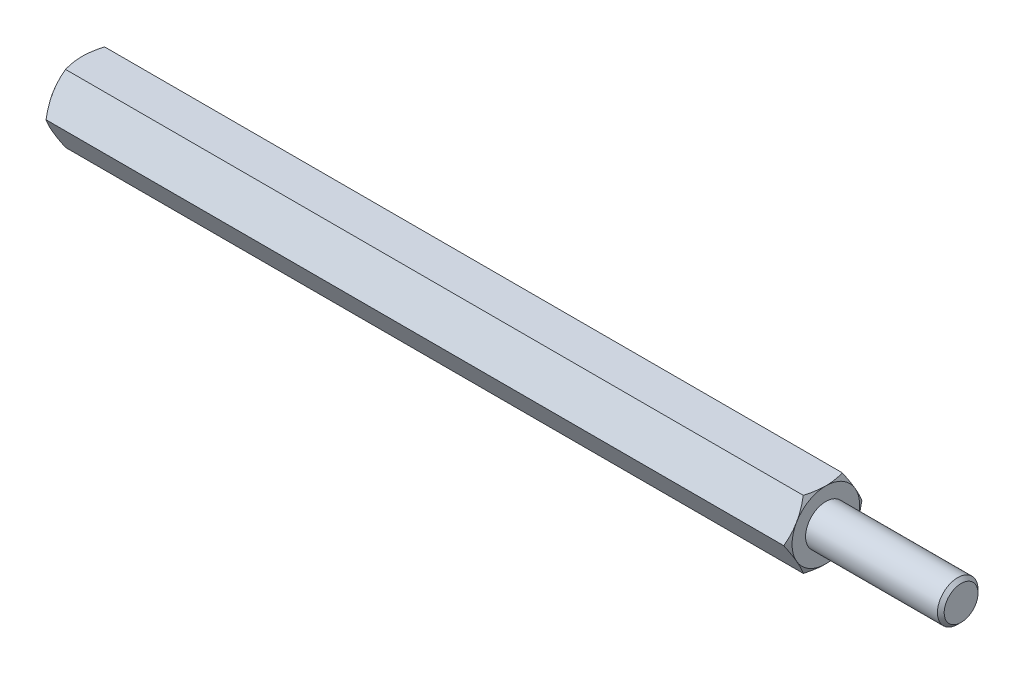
ISO-10303-21;
HEADER;
FILE_DESCRIPTION(('STEP AP214'),'2;1');
FILE_NAME('part.step','',(''),(''),'','','');
FILE_SCHEMA(('AUTOMOTIVE_DESIGN { 1 0 10303 214 1 1 1 1 }'));
ENDSEC;
DATA;
#1=APPLICATION_CONTEXT('core data for automotive mechanical design processes');
#2=APPLICATION_PROTOCOL_DEFINITION('international standard','automotive_design',2000,#1);
#3=PRODUCT_CONTEXT('',#1,'mechanical');
#4=PRODUCT('Part','Part','',(#3));
#5=PRODUCT_RELATED_PRODUCT_CATEGORY('part','',(#4));
#6=PRODUCT_DEFINITION_FORMATION('','',#4);
#7=PRODUCT_DEFINITION_CONTEXT('part definition',#1,'design');
#8=PRODUCT_DEFINITION('design','',#6,#7);
#9=PRODUCT_DEFINITION_SHAPE('','',#8);
#10=(LENGTH_UNIT() NAMED_UNIT(*) SI_UNIT(.MILLI.,.METRE.));
#11=(NAMED_UNIT(*) PLANE_ANGLE_UNIT() SI_UNIT($,.RADIAN.));
#12=(NAMED_UNIT(*) SI_UNIT($,.STERADIAN.) SOLID_ANGLE_UNIT());
#13=UNCERTAINTY_MEASURE_WITH_UNIT(LENGTH_MEASURE(1.E-05),#10,'distance_accuracy_value','');
#14=(GEOMETRIC_REPRESENTATION_CONTEXT(3) GLOBAL_UNCERTAINTY_ASSIGNED_CONTEXT((#13)) GLOBAL_UNIT_ASSIGNED_CONTEXT((#10,
#11,#12)) REPRESENTATION_CONTEXT('',''));
#15=CARTESIAN_POINT('',(0.,0.,0.));
#16=DIRECTION('',(0.,0.,1.));
#17=DIRECTION('',(1.,0.,0.));
#18=AXIS2_PLACEMENT_3D('',#15,#16,#17);
#19=CARTESIAN_POINT('',(27.5,2.5,-1.44337567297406));
#20=DIRECTION('',(1.,0.,0.));
#21=DIRECTION('',(0.,0.,-1.));
#22=AXIS2_PLACEMENT_3D('',#19,#20,#21);
#23=PLANE('',#22);
#24=CARTESIAN_POINT('',(27.5,0.,0.));
#25=DIRECTION('',(1.,0.,0.));
#26=DIRECTION('',(0.,0.,-1.));
#27=AXIS2_PLACEMENT_3D('',#24,#25,#26);
#28=CIRCLE('',#27,2.50000000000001);
#29=CARTESIAN_POINT('',(27.5,-1.25,-2.16506350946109));
#30=VERTEX_POINT('',#29);
#31=CARTESIAN_POINT('',(27.5,1.25,-2.1650635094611));
#32=VERTEX_POINT('',#31);
#33=EDGE_CURVE('E288',#30,#32,#28,.T.);
#34=ORIENTED_EDGE('',*,*,#33,.T.);
#35=CARTESIAN_POINT('',(27.5,2.5,0.));
#36=VERTEX_POINT('',#35);
#37=EDGE_CURVE('E53',#32,#36,#28,.T.);
#38=ORIENTED_EDGE('',*,*,#37,.T.);
#39=CARTESIAN_POINT('',(27.5,1.25,2.1650635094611));
#40=VERTEX_POINT('',#39);
#41=EDGE_CURVE('E297',#36,#40,#28,.T.);
#42=ORIENTED_EDGE('',*,*,#41,.T.);
#43=CARTESIAN_POINT('',(27.5,-1.25000000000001,2.1650635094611));
#44=VERTEX_POINT('',#43);
#45=EDGE_CURVE('E303',#40,#44,#28,.T.);
#46=ORIENTED_EDGE('',*,*,#45,.T.);
#47=CARTESIAN_POINT('',(27.5,0.,0.));
#48=DIRECTION('',(-1.,0.,0.));
#49=DIRECTION('',(0.,-1.,0.));
#50=AXIS2_PLACEMENT_3D('',#47,#48,#49);
#51=CIRCLE('',#50,2.50000000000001);
#52=CARTESIAN_POINT('',(27.5,-2.50000000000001,0.));
#53=VERTEX_POINT('',#52);
#54=EDGE_CURVE('E193',#53,#44,#51,.T.);
#55=ORIENTED_EDGE('',*,*,#54,.F.);
#56=EDGE_CURVE('E61',#53,#30,#28,.T.);
#57=ORIENTED_EDGE('',*,*,#56,.T.);
#58=EDGE_LOOP('',(#34,#38,#42,#46,#55,#57));
#59=FACE_BOUND('',#58,.T.);
#60=CARTESIAN_POINT('',(27.5,0.,0.));
#61=DIRECTION('',(1.,0.,0.));
#62=DIRECTION('',(0.,0.,-1.));
#63=AXIS2_PLACEMENT_3D('',#60,#61,#62);
#64=CIRCLE('',#63,1.5);
#65=CARTESIAN_POINT('',(27.5,0.,-1.5));
#66=VERTEX_POINT('',#65);
#67=EDGE_CURVE('E617',#66,#66,#64,.T.);
#68=ORIENTED_EDGE('',*,*,#67,.F.);
#69=EDGE_LOOP('',(#68));
#70=FACE_BOUND('',#69,.T.);
#71=ADVANCED_FACE('F37',(#59,#70),#23,.T.);
#72=CARTESIAN_POINT('',(27.5,0.,-2.88675134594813));
#73=DIRECTION('',(0.,-0.5,0.866025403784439));
#74=DIRECTION('',(0.,-0.866025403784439,-0.5));
#75=AXIS2_PLACEMENT_3D('',#72,#73,#74);
#76=PLANE('',#75);
#77=CARTESIAN_POINT('',(27.2766423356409,-0.000200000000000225,-2.88686681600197));
#78=CARTESIAN_POINT('',(27.3132783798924,0.109663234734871,-2.82343724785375));
#79=CARTESIAN_POINT('',(27.3465977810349,0.220474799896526,-2.75946016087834));
#80=CARTESIAN_POINT('',(27.4047577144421,0.444016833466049,-2.63039810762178));
#81=CARTESIAN_POINT('',(27.4295776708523,0.556751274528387,-2.5653108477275));
#82=CARTESIAN_POINT('',(27.468214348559,0.780822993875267,-2.43594298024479));
#83=CARTESIAN_POINT('',(27.4822882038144,0.892125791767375,-2.37168227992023));
#84=CARTESIAN_POINT('',(27.4990908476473,1.11525522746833,-2.24285844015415));
#85=CARTESIAN_POINT('',(27.5018335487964,1.22708105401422,-2.17829576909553));
#86=CARTESIAN_POINT('',(27.4961342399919,1.43604197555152,-2.05765212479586));
#87=CARTESIAN_POINT('',(27.4890916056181,1.53320831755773,-2.0015531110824));
#88=CARTESIAN_POINT('',(27.4667685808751,1.726907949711,-1.88972057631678));
#89=CARTESIAN_POINT('',(27.4514805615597,1.82344056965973,-1.8339874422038));
#90=CARTESIAN_POINT('',(27.4132609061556,2.01753972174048,-1.7219242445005));
#91=CARTESIAN_POINT('',(27.3901672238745,2.11508168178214,-1.66560836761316));
#92=CARTESIAN_POINT('',(27.3377533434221,2.30871060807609,-1.55381665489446));
#93=CARTESIAN_POINT('',(27.3084454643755,2.40480005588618,-1.49833938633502));
#94=CARTESIAN_POINT('',(27.2766423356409,2.5002,-1.44326020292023));
#95=B_SPLINE_CURVE_WITH_KNOTS('',3,(#77,#78,#79,#80,#81,#82,#83,#84,#85,#86,#87,#88,#89,#90,#91,
#92,#93,#94),.UNSPECIFIED.,.F.,.F.,(4,2,2,2,2,2,2,2,4),(0.,0.396285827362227,0.793524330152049,
1.18093086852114,1.56786160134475,1.90479741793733,2.24204551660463,2.58677531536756,
2.93082800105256),.UNSPECIFIED.);
#96=CARTESIAN_POINT('',(27.2767090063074,0.,-2.88675134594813));
#97=VERTEX_POINT('',#96);
#98=EDGE_CURVE('E317',#97,#32,#95,.T.);
#99=ORIENTED_EDGE('',*,*,#98,.F.);
#100=DIRECTION('',(-1.,0.,0.));
#101=VECTOR('',#100,1.);
#102=CARTESIAN_POINT('',(27.5,0.,-2.88675134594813));
#103=LINE('',#102,#101);
#104=CARTESIAN_POINT('',(-27.2767090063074,0.,-2.88675134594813));
#105=VERTEX_POINT('',#104);
#106=EDGE_CURVE('E264',#97,#105,#103,.T.);
#107=ORIENTED_EDGE('',*,*,#106,.T.);
#108=CARTESIAN_POINT('',(-27.2766423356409,2.5002,-1.44326020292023));
#109=CARTESIAN_POINT('',(-27.3132783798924,2.39033676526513,-1.50668977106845));
#110=CARTESIAN_POINT('',(-27.3465977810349,2.27952520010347,-1.57066685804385));
#111=CARTESIAN_POINT('',(-27.4047577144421,2.05598316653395,-1.69972891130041));
#112=CARTESIAN_POINT('',(-27.4295776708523,1.94324872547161,-1.7648161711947));
#113=CARTESIAN_POINT('',(-27.468214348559,1.71917700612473,-1.8941840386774));
#114=CARTESIAN_POINT('',(-27.4822882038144,1.60787420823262,-1.95844473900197));
#115=CARTESIAN_POINT('',(-27.4990908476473,1.38474477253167,-2.08726857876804));
#116=CARTESIAN_POINT('',(-27.5018335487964,1.27291894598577,-2.15183124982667));
#117=CARTESIAN_POINT('',(-27.4961342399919,1.06395802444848,-2.27247489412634));
#118=CARTESIAN_POINT('',(-27.4890916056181,0.966791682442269,-2.32857390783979));
#119=CARTESIAN_POINT('',(-27.4667685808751,0.773092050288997,-2.44040644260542));
#120=CARTESIAN_POINT('',(-27.4514805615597,0.676559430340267,-2.4961395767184));
#121=CARTESIAN_POINT('',(-27.4132609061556,0.482460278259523,-2.60820277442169));
#122=CARTESIAN_POINT('',(-27.3901672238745,0.384918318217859,-2.66451865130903));
#123=CARTESIAN_POINT('',(-27.3377533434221,0.191289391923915,-2.77631036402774));
#124=CARTESIAN_POINT('',(-27.3084454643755,0.0951999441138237,-2.83178763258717));
#125=CARTESIAN_POINT('',(-27.2766423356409,-0.000200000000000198,-2.88686681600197));
#126=B_SPLINE_CURVE_WITH_KNOTS('',3,(#108,#109,#110,#111,#112,#113,#114,#115,#116,#117,#118,
#119,#120,#121,#122,#123,#124,#125),.UNSPECIFIED.,.F.,.F.,(4,2,2,2,2,2,2,2,4),(0.,
0.396285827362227,0.79352433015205,1.18093086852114,1.56786160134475,1.90479741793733,
2.24204551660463,2.58677531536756,2.93082800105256),.UNSPECIFIED.);
#127=CARTESIAN_POINT('',(-27.5,1.25,-2.1650635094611));
#128=VERTEX_POINT('',#127);
#129=EDGE_CURVE('E379',#128,#105,#126,.T.);
#130=ORIENTED_EDGE('',*,*,#129,.F.);
#131=CARTESIAN_POINT('',(-27.2767090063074,2.5,-1.44337567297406));
#132=VERTEX_POINT('',#131);
#133=EDGE_CURVE('E356',#132,#128,#126,.T.);
#134=ORIENTED_EDGE('',*,*,#133,.F.);
#135=DIRECTION('',(-1.,0.,0.));
#136=VECTOR('',#135,1.);
#137=CARTESIAN_POINT('',(27.5,2.5,-1.44337567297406));
#138=LINE('',#137,#136);
#139=CARTESIAN_POINT('',(27.2767090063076,2.5,-1.44337567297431));
#140=VERTEX_POINT('',#139);
#141=EDGE_CURVE('E279',#140,#132,#138,.T.);
#142=ORIENTED_EDGE('',*,*,#141,.F.);
#143=EDGE_CURVE('E229',#32,#140,#95,.T.);
#144=ORIENTED_EDGE('',*,*,#143,.F.);
#145=EDGE_LOOP('',(#99,#107,#130,#134,#142,#144));
#146=FACE_BOUND('',#145,.T.);
#147=ADVANCED_FACE('F148',(#146),#76,.F.);
#148=CARTESIAN_POINT('',(27.5,2.5,-1.44337567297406));
#149=DIRECTION('',(0.,-1.,0.));
#150=DIRECTION('',(0.,0.,-1.));
#151=AXIS2_PLACEMENT_3D('',#148,#149,#150);
#152=PLANE('',#151);
#153=CARTESIAN_POINT('',(26.2680338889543,2.5,-3.90158441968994));
#154=CARTESIAN_POINT('',(26.3212077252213,2.5,-3.79217004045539));
#155=CARTESIAN_POINT('',(26.3738786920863,2.5,-3.68250707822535));
#156=CARTESIAN_POINT('',(26.4779324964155,2.5,-3.46255185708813));
#157=CARTESIAN_POINT('',(26.5293151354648,2.5,-3.35225950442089));
#158=CARTESIAN_POINT('',(26.6307630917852,2.5,-3.13035696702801));
#159=CARTESIAN_POINT('',(26.6808199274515,2.5,-3.0187428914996));
#160=CARTESIAN_POINT('',(26.7789171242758,2.5,-2.79463535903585));
#161=CARTESIAN_POINT('',(26.8269575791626,2.5,-2.6821419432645));
#162=CARTESIAN_POINT('',(26.9220184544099,2.5,-2.45240385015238));
#163=CARTESIAN_POINT('',(26.9689543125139,2.5,-2.33512399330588));
#164=CARTESIAN_POINT('',(27.0593326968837,2.5,-2.09920133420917));
#165=CARTESIAN_POINT('',(27.1027748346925,2.5,-1.98055838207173));
#166=CARTESIAN_POINT('',(27.1850435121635,2.5,-1.74193489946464));
#167=CARTESIAN_POINT('',(27.2238791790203,2.5,-1.62195754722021));
#168=CARTESIAN_POINT('',(27.2957050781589,2.5,-1.38028205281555));
#169=CARTESIAN_POINT('',(27.3286971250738,2.5,-1.25858445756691));
#170=CARTESIAN_POINT('',(27.3870959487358,2.5,-1.01406369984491));
#171=CARTESIAN_POINT('',(27.4125437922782,2.5,-0.891250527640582));
#172=CARTESIAN_POINT('',(27.4544275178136,2.5,-0.644071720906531));
#173=CARTESIAN_POINT('',(27.4708643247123,2.5,-0.519706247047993));
#174=CARTESIAN_POINT('',(27.4932006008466,2.5,-0.271679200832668));
#175=CARTESIAN_POINT('',(27.4992375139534,2.5,-0.148030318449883));
#176=CARTESIAN_POINT('',(27.5006256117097,2.5,0.0993395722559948));
#177=CARTESIAN_POINT('',(27.4959765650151,2.5,0.223060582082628));
#178=CARTESIAN_POINT('',(27.4794044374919,2.5,0.432351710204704));
#179=CARTESIAN_POINT('',(27.4701066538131,2.5,0.518143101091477));
#180=CARTESIAN_POINT('',(27.4469384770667,2.5,0.689112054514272));
#181=CARTESIAN_POINT('',(27.4330674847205,2.5,0.774289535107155));
#182=CARTESIAN_POINT('',(27.3853202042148,2.5,1.02876599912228));
#183=CARTESIAN_POINT('',(27.3453176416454,2.5,1.19691958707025));
#184=CARTESIAN_POINT('',(27.2522656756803,2.5,1.53362893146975));
#185=CARTESIAN_POINT('',(27.1989362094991,2.5,1.70210423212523));
#186=CARTESIAN_POINT('',(27.1123716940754,2.5,1.95247339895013));
#187=CARTESIAN_POINT('',(27.0824247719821,2.5,2.03553184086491));
#188=CARTESIAN_POINT('',(27.0206840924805,2.5,2.20095860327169));
#189=CARTESIAN_POINT('',(26.9888903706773,2.5,2.28332693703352));
#190=CARTESIAN_POINT('',(26.904014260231,2.5,2.49723312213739));
#191=CARTESIAN_POINT('',(26.8497173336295,2.5,2.62828796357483));
#192=CARTESIAN_POINT('',(26.7381273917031,2.5,2.88912034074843));
#193=CARTESIAN_POINT('',(26.6808341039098,2.5,3.01889775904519));
#194=CARTESIAN_POINT('',(26.5639348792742,2.5,3.2774504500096));
#195=CARTESIAN_POINT('',(26.504328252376,2.5,3.40622540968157));
#196=CARTESIAN_POINT('',(26.3833234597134,2.5,3.6629323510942));
#197=CARTESIAN_POINT('',(26.321925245,2.5,3.79086430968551));
#198=CARTESIAN_POINT('',(26.1354580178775,2.5,4.17399495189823));
#199=CARTESIAN_POINT('',(26.0082824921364,2.5,4.4281672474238));
#200=CARTESIAN_POINT('',(25.7503455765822,2.5,4.93461464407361));
#201=CARTESIAN_POINT('',(25.6195848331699,2.5,5.18689007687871));
#202=CARTESIAN_POINT('',(25.3687100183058,2.5,5.6651245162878));
#203=CARTESIAN_POINT('',(25.2488298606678,2.5,5.89120644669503));
#204=CARTESIAN_POINT('',(25.0075902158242,2.5,6.3425936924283));
#205=CARTESIAN_POINT('',(24.8862306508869,2.5,6.56789896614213));
#206=CARTESIAN_POINT('',(24.642780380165,2.5,7.01722044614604));
#207=CARTESIAN_POINT('',(24.5206930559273,2.5,7.2412384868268));
#208=CARTESIAN_POINT('',(24.2756662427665,2.5,7.68878772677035));
#209=CARTESIAN_POINT('',(24.152726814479,2.5,7.91231895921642));
#210=CARTESIAN_POINT('',(24.0294756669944,2.5,8.13567697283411));
#211=B_SPLINE_CURVE_WITH_KNOTS('',3,(#153,#154,#155,#156,#157,#158,#159,#160,#161,#162,#163,
#164,#165,#166,#167,#168,#169,#170,#171,#172,#173,#174,#175,#176,#177,#178,#179,#180,#181,#182,
#183,#184,#185,#186,#187,#188,#189,#190,#191,#192,#193,#194,#195,#196,#197,#198,#199,#200,#201,
#202,#203,#204,#205,#206,#207,#208,#209,#210),.UNSPECIFIED.,.F.,.F.,(4,2,2,2,2,2,2,2,2,2,2,2,2,
2,2,2,2,2,2,2,2,2,2,2,2,2,2,2,4),(0.,0.364957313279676,0.729970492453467,1.09692930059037,
1.46387103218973,1.84279746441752,2.22176597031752,2.59997058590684,2.97805755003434,
3.3540469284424,3.72999770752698,4.10094071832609,4.47189175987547,4.73064905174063,
4.98944026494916,5.50729076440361,6.03710483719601,6.30196454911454,6.56681915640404,
6.99233818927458,7.41789598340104,7.84358170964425,8.26927907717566,9.12186602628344,
9.97430025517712,10.7419897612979,11.509719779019,12.2750964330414,13.0404191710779),.UNSPECIFIED.);
#212=EDGE_CURVE('E227',#140,#36,#211,.T.);
#213=ORIENTED_EDGE('',*,*,#212,.F.);
#214=ORIENTED_EDGE('',*,*,#141,.T.);
#215=CARTESIAN_POINT('',(-26.2680338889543,2.5,-3.90158441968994));
#216=CARTESIAN_POINT('',(-26.3212077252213,2.5,-3.79217004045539));
#217=CARTESIAN_POINT('',(-26.3738786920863,2.5,-3.68250707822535));
#218=CARTESIAN_POINT('',(-26.4779324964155,2.5,-3.46255185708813));
#219=CARTESIAN_POINT('',(-26.5293151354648,2.5,-3.35225950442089));
#220=CARTESIAN_POINT('',(-26.6307630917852,2.5,-3.13035696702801));
#221=CARTESIAN_POINT('',(-26.6808199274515,2.5,-3.0187428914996));
#222=CARTESIAN_POINT('',(-26.7789171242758,2.5,-2.79463535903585));
#223=CARTESIAN_POINT('',(-26.8269575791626,2.5,-2.6821419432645));
#224=CARTESIAN_POINT('',(-26.9220184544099,2.5,-2.45240385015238));
#225=CARTESIAN_POINT('',(-26.9689543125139,2.5,-2.33512399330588));
#226=CARTESIAN_POINT('',(-27.0593326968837,2.5,-2.09920133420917));
#227=CARTESIAN_POINT('',(-27.1027748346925,2.5,-1.98055838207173));
#228=CARTESIAN_POINT('',(-27.1850435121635,2.5,-1.74193489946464));
#229=CARTESIAN_POINT('',(-27.2238791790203,2.5,-1.62195754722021));
#230=CARTESIAN_POINT('',(-27.2957050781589,2.5,-1.38028205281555));
#231=CARTESIAN_POINT('',(-27.3286971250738,2.5,-1.25858445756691));
#232=CARTESIAN_POINT('',(-27.3870959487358,2.5,-1.01406369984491));
#233=CARTESIAN_POINT('',(-27.4125437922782,2.5,-0.891250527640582));
#234=CARTESIAN_POINT('',(-27.4544275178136,2.5,-0.644071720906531));
#235=CARTESIAN_POINT('',(-27.4708643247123,2.5,-0.519706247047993));
#236=CARTESIAN_POINT('',(-27.4932006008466,2.5,-0.271679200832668));
#237=CARTESIAN_POINT('',(-27.4992375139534,2.5,-0.148030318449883));
#238=CARTESIAN_POINT('',(-27.5006256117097,2.5,0.0993395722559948));
#239=CARTESIAN_POINT('',(-27.4959765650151,2.5,0.223060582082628));
#240=CARTESIAN_POINT('',(-27.4794044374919,2.5,0.432351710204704));
#241=CARTESIAN_POINT('',(-27.4701066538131,2.5,0.518143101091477));
#242=CARTESIAN_POINT('',(-27.4469384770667,2.5,0.689112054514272));
#243=CARTESIAN_POINT('',(-27.4330674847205,2.5,0.774289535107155));
#244=CARTESIAN_POINT('',(-27.3853202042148,2.5,1.02876599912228));
#245=CARTESIAN_POINT('',(-27.3453176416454,2.5,1.19691958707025));
#246=CARTESIAN_POINT('',(-27.2522656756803,2.5,1.53362893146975));
#247=CARTESIAN_POINT('',(-27.1989362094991,2.5,1.70210423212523));
#248=CARTESIAN_POINT('',(-27.1123716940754,2.5,1.95247339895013));
#249=CARTESIAN_POINT('',(-27.0824247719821,2.5,2.03553184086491));
#250=CARTESIAN_POINT('',(-27.0206840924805,2.5,2.20095860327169));
#251=CARTESIAN_POINT('',(-26.9888903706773,2.5,2.28332693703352));
#252=CARTESIAN_POINT('',(-26.904014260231,2.5,2.49723312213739));
#253=CARTESIAN_POINT('',(-26.8497173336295,2.5,2.62828796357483));
#254=CARTESIAN_POINT('',(-26.7381273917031,2.5,2.88912034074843));
#255=CARTESIAN_POINT('',(-26.6808341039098,2.5,3.01889775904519));
#256=CARTESIAN_POINT('',(-26.5639348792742,2.5,3.2774504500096));
#257=CARTESIAN_POINT('',(-26.504328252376,2.5,3.40622540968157));
#258=CARTESIAN_POINT('',(-26.3833234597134,2.5,3.6629323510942));
#259=CARTESIAN_POINT('',(-26.321925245,2.5,3.79086430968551));
#260=CARTESIAN_POINT('',(-26.1354580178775,2.5,4.17399495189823));
#261=CARTESIAN_POINT('',(-26.0082824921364,2.5,4.4281672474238));
#262=CARTESIAN_POINT('',(-25.7503455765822,2.5,4.93461464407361));
#263=CARTESIAN_POINT('',(-25.6195848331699,2.5,5.18689007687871));
#264=CARTESIAN_POINT('',(-25.3687100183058,2.5,5.6651245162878));
#265=CARTESIAN_POINT('',(-25.2488298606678,2.5,5.89120644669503));
#266=CARTESIAN_POINT('',(-25.0075902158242,2.5,6.3425936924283));
#267=CARTESIAN_POINT('',(-24.8862306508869,2.5,6.56789896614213));
#268=CARTESIAN_POINT('',(-24.642780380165,2.5,7.01722044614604));
#269=CARTESIAN_POINT('',(-24.5206930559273,2.5,7.2412384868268));
#270=CARTESIAN_POINT('',(-24.2756662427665,2.5,7.68878772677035));
#271=CARTESIAN_POINT('',(-24.152726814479,2.5,7.91231895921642));
#272=CARTESIAN_POINT('',(-24.0294756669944,2.5,8.13567697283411));
#273=B_SPLINE_CURVE_WITH_KNOTS('',3,(#215,#216,#217,#218,#219,#220,#221,#222,#223,#224,#225,
#226,#227,#228,#229,#230,#231,#232,#233,#234,#235,#236,#237,#238,#239,#240,#241,#242,#243,#244,
#245,#246,#247,#248,#249,#250,#251,#252,#253,#254,#255,#256,#257,#258,#259,#260,#261,#262,#263,
#264,#265,#266,#267,#268,#269,#270,#271,#272),.UNSPECIFIED.,.F.,.F.,(4,2,2,2,2,2,2,2,2,2,2,2,2,
2,2,2,2,2,2,2,2,2,2,2,2,2,2,2,4),(0.,0.364957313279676,0.729970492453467,1.09692930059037,
1.46387103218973,1.84279746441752,2.22176597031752,2.59997058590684,2.97805755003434,
3.3540469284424,3.72999770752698,4.10094071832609,4.47189175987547,4.73064905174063,
4.98944026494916,5.50729076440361,6.03710483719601,6.30196454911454,6.56681915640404,
6.99233818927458,7.41789598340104,7.84358170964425,8.26927907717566,9.12186602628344,
9.97430025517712,10.7419897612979,11.509719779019,12.2750964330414,13.0404191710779),.UNSPECIFIED.);
#274=CARTESIAN_POINT('',(-27.5,2.5,0.));
#275=VERTEX_POINT('',#274);
#276=EDGE_CURVE('E241',#275,#132,#273,.F.);
#277=ORIENTED_EDGE('',*,*,#276,.F.);
#278=CARTESIAN_POINT('',(-27.2767090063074,2.5,1.44337567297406));
#279=VERTEX_POINT('',#278);
#280=EDGE_CURVE('E249',#279,#275,#273,.F.);
#281=ORIENTED_EDGE('',*,*,#280,.F.);
#282=DIRECTION('',(-1.,0.,0.));
#283=VECTOR('',#282,1.);
#284=CARTESIAN_POINT('',(27.5,2.5,1.44337567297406));
#285=LINE('',#284,#283);
#286=CARTESIAN_POINT('',(27.2767090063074,2.5,1.44337567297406));
#287=VERTEX_POINT('',#286);
#288=EDGE_CURVE('E276',#287,#279,#285,.T.);
#289=ORIENTED_EDGE('',*,*,#288,.F.);
#290=EDGE_CURVE('E221',#36,#287,#211,.T.);
#291=ORIENTED_EDGE('',*,*,#290,.F.);
#292=EDGE_LOOP('',(#213,#214,#277,#281,#289,#291));
#293=FACE_BOUND('',#292,.T.);
#294=ADVANCED_FACE('F153',(#293),#152,.F.);
#295=CARTESIAN_POINT('',(27.5,2.5,1.44337567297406));
#296=DIRECTION('',(0.,-0.5,-0.866025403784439));
#297=DIRECTION('',(0.,0.866025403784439,-0.5));
#298=AXIS2_PLACEMENT_3D('',#295,#296,#297);
#299=PLANE('',#298);
#300=CARTESIAN_POINT('',(27.2766423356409,2.5002,1.44326020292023));
#301=CARTESIAN_POINT('',(27.3132783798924,2.39033676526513,1.50668977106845));
#302=CARTESIAN_POINT('',(27.3465977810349,2.27952520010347,1.57066685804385));
#303=CARTESIAN_POINT('',(27.4047577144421,2.05598316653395,1.69972891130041));
#304=CARTESIAN_POINT('',(27.4295776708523,1.94324872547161,1.7648161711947));
#305=CARTESIAN_POINT('',(27.468214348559,1.71917700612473,1.8941840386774));
#306=CARTESIAN_POINT('',(27.4822882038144,1.60787420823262,1.95844473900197));
#307=CARTESIAN_POINT('',(27.4990908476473,1.38474477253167,2.08726857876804));
#308=CARTESIAN_POINT('',(27.5018335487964,1.27291894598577,2.15183124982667));
#309=CARTESIAN_POINT('',(27.4961342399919,1.06395802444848,2.27247489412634));
#310=CARTESIAN_POINT('',(27.4890916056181,0.966791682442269,2.32857390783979));
#311=CARTESIAN_POINT('',(27.4667685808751,0.773092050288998,2.44040644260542));
#312=CARTESIAN_POINT('',(27.4514805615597,0.676559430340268,2.4961395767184));
#313=CARTESIAN_POINT('',(27.4132609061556,0.482460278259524,2.60820277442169));
#314=CARTESIAN_POINT('',(27.3901672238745,0.384918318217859,2.66451865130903));
#315=CARTESIAN_POINT('',(27.3377533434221,0.191289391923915,2.77631036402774));
#316=CARTESIAN_POINT('',(27.3084454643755,0.0951999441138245,2.83178763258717));
#317=CARTESIAN_POINT('',(27.2766423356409,-0.000199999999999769,2.88686681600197));
#318=B_SPLINE_CURVE_WITH_KNOTS('',3,(#300,#301,#302,#303,#304,#305,#306,#307,#308,#309,#310,
#311,#312,#313,#314,#315,#316,#317),.UNSPECIFIED.,.F.,.F.,(4,2,2,2,2,2,2,2,4),(0.,
0.396285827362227,0.793524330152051,1.18093086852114,1.56786160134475,1.90479741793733,
2.24204551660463,2.58677531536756,2.93082800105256),.UNSPECIFIED.);
#319=EDGE_CURVE('E228',#287,#40,#318,.T.);
#320=ORIENTED_EDGE('',*,*,#319,.F.);
#321=ORIENTED_EDGE('',*,*,#288,.T.);
#322=CARTESIAN_POINT('',(-27.2766423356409,-0.000200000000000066,2.88686681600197));
#323=CARTESIAN_POINT('',(-27.3132783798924,0.109663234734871,2.82343724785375));
#324=CARTESIAN_POINT('',(-27.3465977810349,0.220474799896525,2.75946016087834));
#325=CARTESIAN_POINT('',(-27.4047577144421,0.444016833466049,2.63039810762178));
#326=CARTESIAN_POINT('',(-27.4295776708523,0.556751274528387,2.5653108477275));
#327=CARTESIAN_POINT('',(-27.468214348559,0.780822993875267,2.43594298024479));
#328=CARTESIAN_POINT('',(-27.4822882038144,0.892125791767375,2.37168227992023));
#329=CARTESIAN_POINT('',(-27.4990908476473,1.11525522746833,2.24285844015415));
#330=CARTESIAN_POINT('',(-27.5018335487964,1.22708105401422,2.17829576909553));
#331=CARTESIAN_POINT('',(-27.4961342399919,1.43604197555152,2.05765212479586));
#332=CARTESIAN_POINT('',(-27.4890916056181,1.53320831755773,2.0015531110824));
#333=CARTESIAN_POINT('',(-27.4667685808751,1.726907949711,1.88972057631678));
#334=CARTESIAN_POINT('',(-27.4514805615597,1.82344056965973,1.8339874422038));
#335=CARTESIAN_POINT('',(-27.4132609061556,2.01753972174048,1.7219242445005));
#336=CARTESIAN_POINT('',(-27.3901672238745,2.11508168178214,1.66560836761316));
#337=CARTESIAN_POINT('',(-27.3377533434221,2.30871060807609,1.55381665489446));
#338=CARTESIAN_POINT('',(-27.3084454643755,2.40480005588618,1.49833938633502));
#339=CARTESIAN_POINT('',(-27.2766423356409,2.5002,1.44326020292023));
#340=B_SPLINE_CURVE_WITH_KNOTS('',3,(#322,#323,#324,#325,#326,#327,#328,#329,#330,#331,#332,
#333,#334,#335,#336,#337,#338,#339),.UNSPECIFIED.,.F.,.F.,(4,2,2,2,2,2,2,2,4),(0.,
0.396285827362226,0.793524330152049,1.18093086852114,1.56786160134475,1.90479741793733,
2.24204551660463,2.58677531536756,2.93082800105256),.UNSPECIFIED.);
#341=CARTESIAN_POINT('',(-27.5,1.25,2.1650635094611));
#342=VERTEX_POINT('',#341);
#343=EDGE_CURVE('E255',#342,#279,#340,.T.);
#344=ORIENTED_EDGE('',*,*,#343,.F.);
#345=CARTESIAN_POINT('',(-27.2767090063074,0.,2.88675134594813));
#346=VERTEX_POINT('',#345);
#347=EDGE_CURVE('E262',#346,#342,#340,.T.);
#348=ORIENTED_EDGE('',*,*,#347,.F.);
#349=DIRECTION('',(-1.,0.,0.));
#350=VECTOR('',#349,1.);
#351=CARTESIAN_POINT('',(27.5,0.,2.88675134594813));
#352=LINE('',#351,#350);
#353=CARTESIAN_POINT('',(27.2767090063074,0.,2.88675134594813));
#354=VERTEX_POINT('',#353);
#355=EDGE_CURVE('E273',#354,#346,#352,.T.);
#356=ORIENTED_EDGE('',*,*,#355,.F.);
#357=EDGE_CURVE('E215',#40,#354,#318,.T.);
#358=ORIENTED_EDGE('',*,*,#357,.F.);
#359=EDGE_LOOP('',(#320,#321,#344,#348,#356,#358));
#360=FACE_BOUND('',#359,.T.);
#361=ADVANCED_FACE('F235',(#360),#299,.F.);
#362=CARTESIAN_POINT('',(27.5,0.,2.88675134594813));
#363=DIRECTION('',(0.,0.5,-0.866025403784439));
#364=DIRECTION('',(0.,0.866025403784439,0.5));
#365=AXIS2_PLACEMENT_3D('',#362,#363,#364);
#366=PLANE('',#365);
#367=CARTESIAN_POINT('',(27.2766423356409,0.000200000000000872,2.88686681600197));
#368=CARTESIAN_POINT('',(27.3132783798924,-0.10966323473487,2.82343724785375));
#369=CARTESIAN_POINT('',(27.3465977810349,-0.220474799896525,2.75946016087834));
#370=CARTESIAN_POINT('',(27.4047577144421,-0.444016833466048,2.63039810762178));
#371=CARTESIAN_POINT('',(27.4295776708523,-0.556751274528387,2.5653108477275));
#372=CARTESIAN_POINT('',(27.468214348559,-0.780822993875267,2.43594298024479));
#373=CARTESIAN_POINT('',(27.4822882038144,-0.892125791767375,2.37168227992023));
#374=CARTESIAN_POINT('',(27.4990908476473,-1.11525522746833,2.24285844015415));
#375=CARTESIAN_POINT('',(27.5018335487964,-1.22708105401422,2.17829576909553));
#376=CARTESIAN_POINT('',(27.496134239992,-1.43604197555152,2.05765212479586));
#377=CARTESIAN_POINT('',(27.4890916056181,-1.53320831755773,2.0015531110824));
#378=CARTESIAN_POINT('',(27.4667685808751,-1.726907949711,1.88972057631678));
#379=CARTESIAN_POINT('',(27.4514805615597,-1.82344056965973,1.8339874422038));
#380=CARTESIAN_POINT('',(27.4132609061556,-2.01753972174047,1.7219242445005));
#381=CARTESIAN_POINT('',(27.3901672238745,-2.11508168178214,1.66560836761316));
#382=CARTESIAN_POINT('',(27.3377533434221,-2.30871060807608,1.55381665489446));
#383=CARTESIAN_POINT('',(27.3084454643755,-2.40480005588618,1.49833938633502));
#384=CARTESIAN_POINT('',(27.2766423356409,-2.5002,1.44326020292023));
#385=B_SPLINE_CURVE_WITH_KNOTS('',3,(#367,#368,#369,#370,#371,#372,#373,#374,#375,#376,#377,
#378,#379,#380,#381,#382,#383,#384),.UNSPECIFIED.,.F.,.F.,(4,2,2,2,2,2,2,2,4),(0.,
0.396285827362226,0.79352433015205,1.18093086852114,1.56786160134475,1.90479741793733,
2.24204551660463,2.58677531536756,2.93082800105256),.UNSPECIFIED.);
#386=EDGE_CURVE('E337',#354,#44,#385,.T.);
#387=ORIENTED_EDGE('',*,*,#386,.F.);
#388=ORIENTED_EDGE('',*,*,#355,.T.);
#389=CARTESIAN_POINT('',(-27.2766423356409,-2.5002,1.44326020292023));
#390=CARTESIAN_POINT('',(-27.3132783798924,-2.39033676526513,1.50668977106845));
#391=CARTESIAN_POINT('',(-27.346597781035,-2.27952520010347,1.57066685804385));
#392=CARTESIAN_POINT('',(-27.4047577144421,-2.05598316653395,1.69972891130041));
#393=CARTESIAN_POINT('',(-27.4295776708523,-1.94324872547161,1.7648161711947));
#394=CARTESIAN_POINT('',(-27.468214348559,-1.71917700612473,1.8941840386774));
#395=CARTESIAN_POINT('',(-27.4822882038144,-1.60787420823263,1.95844473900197));
#396=CARTESIAN_POINT('',(-27.4990908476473,-1.38474477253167,2.08726857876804));
#397=CARTESIAN_POINT('',(-27.5018335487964,-1.27291894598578,2.15183124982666));
#398=CARTESIAN_POINT('',(-27.496134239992,-1.06395802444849,2.27247489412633));
#399=CARTESIAN_POINT('',(-27.4890916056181,-0.966791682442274,2.32857390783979));
#400=CARTESIAN_POINT('',(-27.4667685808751,-0.773092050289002,2.44040644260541));
#401=CARTESIAN_POINT('',(-27.4514805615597,-0.676559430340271,2.49613957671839));
#402=CARTESIAN_POINT('',(-27.4132609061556,-0.482460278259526,2.60820277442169));
#403=CARTESIAN_POINT('',(-27.3901672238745,-0.384918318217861,2.66451865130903));
#404=CARTESIAN_POINT('',(-27.3377533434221,-0.191289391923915,2.77631036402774));
#405=CARTESIAN_POINT('',(-27.3084454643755,-0.0951999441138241,2.83178763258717));
#406=CARTESIAN_POINT('',(-27.2766423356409,0.000200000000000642,2.88686681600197));
#407=B_SPLINE_CURVE_WITH_KNOTS('',3,(#389,#390,#391,#392,#393,#394,#395,#396,#397,#398,#399,
#400,#401,#402,#403,#404,#405,#406),.UNSPECIFIED.,.F.,.F.,(4,2,2,2,2,2,2,2,4),(0.,
0.396285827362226,0.793524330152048,1.18093086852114,1.56786160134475,1.90479741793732,
2.24204551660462,2.58677531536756,2.93082800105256),.UNSPECIFIED.);
#408=CARTESIAN_POINT('',(-27.5,-1.25000000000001,2.1650635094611));
#409=VERTEX_POINT('',#408);
#410=EDGE_CURVE('E263',#409,#346,#407,.T.);
#411=ORIENTED_EDGE('',*,*,#410,.F.);
#412=CARTESIAN_POINT('',(-27.2767090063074,-2.5,1.44337567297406));
#413=VERTEX_POINT('',#412);
#414=EDGE_CURVE('E250',#413,#409,#407,.T.);
#415=ORIENTED_EDGE('',*,*,#414,.F.);
#416=DIRECTION('',(-1.,0.,0.));
#417=VECTOR('',#416,1.);
#418=CARTESIAN_POINT('',(27.5,-2.5,1.44337567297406));
#419=LINE('',#418,#417);
#420=CARTESIAN_POINT('',(27.2767090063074,-2.5,1.44337567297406));
#421=VERTEX_POINT('',#420);
#422=EDGE_CURVE('E270',#421,#413,#419,.T.);
#423=ORIENTED_EDGE('',*,*,#422,.F.);
#424=EDGE_CURVE('E210',#44,#421,#385,.T.);
#425=ORIENTED_EDGE('',*,*,#424,.F.);
#426=EDGE_LOOP('',(#387,#388,#411,#415,#423,#425));
#427=FACE_BOUND('',#426,.T.);
#428=ADVANCED_FACE('F410',(#427),#366,.F.);
#429=CARTESIAN_POINT('',(27.5,-2.5,1.44337567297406));
#430=DIRECTION('',(0.,1.,0.));
#431=DIRECTION('',(0.,0.,1.));
#432=AXIS2_PLACEMENT_3D('',#429,#430,#431);
#433=PLANE('',#432);
#434=CARTESIAN_POINT('',(26.2680338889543,-2.5,-3.90158441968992));
#435=CARTESIAN_POINT('',(26.3212077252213,-2.5,-3.79217004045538));
#436=CARTESIAN_POINT('',(26.3738786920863,-2.5,-3.68250707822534));
#437=CARTESIAN_POINT('',(26.4779324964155,-2.5,-3.46255185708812));
#438=CARTESIAN_POINT('',(26.5293151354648,-2.5,-3.35225950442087));
#439=CARTESIAN_POINT('',(26.6307630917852,-2.5,-3.130356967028));
#440=CARTESIAN_POINT('',(26.6808199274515,-2.5,-3.01874289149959));
#441=CARTESIAN_POINT('',(26.7789171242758,-2.5,-2.79463535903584));
#442=CARTESIAN_POINT('',(26.8269575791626,-2.5,-2.68214194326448));
#443=CARTESIAN_POINT('',(26.9220184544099,-2.5,-2.45240385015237));
#444=CARTESIAN_POINT('',(26.9689543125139,-2.5,-2.33512399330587));
#445=CARTESIAN_POINT('',(27.0593326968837,-2.5,-2.09920133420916));
#446=CARTESIAN_POINT('',(27.1027748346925,-2.5,-1.98055838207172));
#447=CARTESIAN_POINT('',(27.1850435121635,-2.5,-1.74193489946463));
#448=CARTESIAN_POINT('',(27.2238791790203,-2.5,-1.6219575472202));
#449=CARTESIAN_POINT('',(27.2957050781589,-2.5,-1.38028205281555));
#450=CARTESIAN_POINT('',(27.3286971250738,-2.5,-1.25858445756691));
#451=CARTESIAN_POINT('',(27.3870959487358,-2.5,-1.01406369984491));
#452=CARTESIAN_POINT('',(27.4125437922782,-2.5,-0.891250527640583));
#453=CARTESIAN_POINT('',(27.4544275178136,-2.5,-0.644071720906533));
#454=CARTESIAN_POINT('',(27.4708643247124,-2.5,-0.519706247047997));
#455=CARTESIAN_POINT('',(27.4932006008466,-2.5,-0.271679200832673));
#456=CARTESIAN_POINT('',(27.4992375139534,-2.5,-0.148030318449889));
#457=CARTESIAN_POINT('',(27.5006256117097,-2.5,0.0993395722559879));
#458=CARTESIAN_POINT('',(27.4959765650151,-2.5,0.223060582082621));
#459=CARTESIAN_POINT('',(27.479404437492,-2.5,0.432351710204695));
#460=CARTESIAN_POINT('',(27.4701066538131,-2.5,0.518143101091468));
#461=CARTESIAN_POINT('',(27.4469384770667,-2.5,0.689112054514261));
#462=CARTESIAN_POINT('',(27.4330674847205,-2.5,0.774289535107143));
#463=CARTESIAN_POINT('',(27.3853202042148,-2.5,1.02876599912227));
#464=CARTESIAN_POINT('',(27.3453176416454,-2.5,1.19691958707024));
#465=CARTESIAN_POINT('',(27.2522656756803,-2.5,1.53362893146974));
#466=CARTESIAN_POINT('',(27.1989362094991,-2.5,1.70210423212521));
#467=CARTESIAN_POINT('',(27.1123716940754,-2.5,1.95247339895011));
#468=CARTESIAN_POINT('',(27.0824247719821,-2.5,2.03553184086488));
#469=CARTESIAN_POINT('',(27.0206840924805,-2.5,2.20095860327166));
#470=CARTESIAN_POINT('',(26.9888903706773,-2.5,2.2833269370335));
#471=CARTESIAN_POINT('',(26.904014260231,-2.5,2.49723312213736));
#472=CARTESIAN_POINT('',(26.8497173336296,-2.5,2.6282879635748));
#473=CARTESIAN_POINT('',(26.7381273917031,-2.5,2.88912034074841));
#474=CARTESIAN_POINT('',(26.6808341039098,-2.5,3.01889775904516));
#475=CARTESIAN_POINT('',(26.5639348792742,-2.5,3.27745045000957));
#476=CARTESIAN_POINT('',(26.504328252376,-2.5,3.40622540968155));
#477=CARTESIAN_POINT('',(26.3833234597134,-2.5,3.66293235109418));
#478=CARTESIAN_POINT('',(26.321925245,-2.5,3.79086430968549));
#479=CARTESIAN_POINT('',(26.1354580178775,-2.5,4.17399495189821));
#480=CARTESIAN_POINT('',(26.0082824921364,-2.5,4.42816724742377));
#481=CARTESIAN_POINT('',(25.7503455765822,-2.5,4.93461464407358));
#482=CARTESIAN_POINT('',(25.6195848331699,-2.5,5.18689007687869));
#483=CARTESIAN_POINT('',(25.3687100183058,-2.5,5.66512451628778));
#484=CARTESIAN_POINT('',(25.2488298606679,-2.5,5.89120644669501));
#485=CARTESIAN_POINT('',(25.0075902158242,-2.5,6.34259369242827));
#486=CARTESIAN_POINT('',(24.8862306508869,-2.5,6.56789896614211));
#487=CARTESIAN_POINT('',(24.642780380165,-2.5,7.01722044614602));
#488=CARTESIAN_POINT('',(24.5206930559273,-2.5,7.24123848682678));
#489=CARTESIAN_POINT('',(24.2756662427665,-2.5,7.68878772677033));
#490=CARTESIAN_POINT('',(24.152726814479,-2.5,7.9123189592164));
#491=CARTESIAN_POINT('',(24.0294756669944,-2.5,8.13567697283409));
#492=B_SPLINE_CURVE_WITH_KNOTS('',3,(#434,#435,#436,#437,#438,#439,#440,#441,#442,#443,#444,
#445,#446,#447,#448,#449,#450,#451,#452,#453,#454,#455,#456,#457,#458,#459,#460,#461,#462,#463,
#464,#465,#466,#467,#468,#469,#470,#471,#472,#473,#474,#475,#476,#477,#478,#479,#480,#481,#482,
#483,#484,#485,#486,#487,#488,#489,#490,#491),.UNSPECIFIED.,.F.,.F.,(4,2,2,2,2,2,2,2,2,2,2,2,2,
2,2,2,2,2,2,2,2,2,2,2,2,2,2,2,4),(0.,0.364957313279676,0.729970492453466,1.09692930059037,
1.46387103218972,1.84279746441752,2.22176597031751,2.59997058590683,2.97805755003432,
3.35404692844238,3.72999770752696,4.10094071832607,4.47189175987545,4.7306490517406,
4.98944026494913,5.50729076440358,6.03710483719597,6.3019645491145,6.566819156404,
6.99233818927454,7.417895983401,7.84358170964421,8.26927907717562,9.1218660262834,
9.97430025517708,10.7419897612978,11.5097197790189,12.2750964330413,13.0404191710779),.UNSPECIFIED.);
#493=EDGE_CURVE('E345',#421,#53,#492,.F.);
#494=ORIENTED_EDGE('',*,*,#493,.F.);
#495=ORIENTED_EDGE('',*,*,#422,.T.);
#496=CARTESIAN_POINT('',(-26.2680338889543,-2.5,-3.90158441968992));
#497=CARTESIAN_POINT('',(-26.3212077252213,-2.5,-3.79217004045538));
#498=CARTESIAN_POINT('',(-26.3738786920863,-2.5,-3.68250707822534));
#499=CARTESIAN_POINT('',(-26.4779324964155,-2.5,-3.46255185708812));
#500=CARTESIAN_POINT('',(-26.5293151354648,-2.5,-3.35225950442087));
#501=CARTESIAN_POINT('',(-26.6307630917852,-2.5,-3.130356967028));
#502=CARTESIAN_POINT('',(-26.6808199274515,-2.5,-3.01874289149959));
#503=CARTESIAN_POINT('',(-26.7789171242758,-2.5,-2.79463535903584));
#504=CARTESIAN_POINT('',(-26.8269575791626,-2.5,-2.68214194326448));
#505=CARTESIAN_POINT('',(-26.9220184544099,-2.5,-2.45240385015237));
#506=CARTESIAN_POINT('',(-26.9689543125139,-2.5,-2.33512399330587));
#507=CARTESIAN_POINT('',(-27.0593326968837,-2.5,-2.09920133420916));
#508=CARTESIAN_POINT('',(-27.1027748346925,-2.5,-1.98055838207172));
#509=CARTESIAN_POINT('',(-27.1850435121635,-2.5,-1.74193489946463));
#510=CARTESIAN_POINT('',(-27.2238791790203,-2.5,-1.6219575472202));
#511=CARTESIAN_POINT('',(-27.2957050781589,-2.5,-1.38028205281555));
#512=CARTESIAN_POINT('',(-27.3286971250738,-2.5,-1.25858445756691));
#513=CARTESIAN_POINT('',(-27.3870959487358,-2.5,-1.01406369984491));
#514=CARTESIAN_POINT('',(-27.4125437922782,-2.5,-0.891250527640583));
#515=CARTESIAN_POINT('',(-27.4544275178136,-2.5,-0.644071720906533));
#516=CARTESIAN_POINT('',(-27.4708643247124,-2.5,-0.519706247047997));
#517=CARTESIAN_POINT('',(-27.4932006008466,-2.5,-0.271679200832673));
#518=CARTESIAN_POINT('',(-27.4992375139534,-2.5,-0.148030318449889));
#519=CARTESIAN_POINT('',(-27.5006256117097,-2.5,0.0993395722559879));
#520=CARTESIAN_POINT('',(-27.4959765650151,-2.5,0.223060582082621));
#521=CARTESIAN_POINT('',(-27.479404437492,-2.5,0.432351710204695));
#522=CARTESIAN_POINT('',(-27.4701066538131,-2.5,0.518143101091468));
#523=CARTESIAN_POINT('',(-27.4469384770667,-2.5,0.689112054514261));
#524=CARTESIAN_POINT('',(-27.4330674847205,-2.5,0.774289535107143));
#525=CARTESIAN_POINT('',(-27.3853202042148,-2.5,1.02876599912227));
#526=CARTESIAN_POINT('',(-27.3453176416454,-2.5,1.19691958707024));
#527=CARTESIAN_POINT('',(-27.2522656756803,-2.5,1.53362893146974));
#528=CARTESIAN_POINT('',(-27.1989362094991,-2.5,1.70210423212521));
#529=CARTESIAN_POINT('',(-27.1123716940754,-2.5,1.95247339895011));
#530=CARTESIAN_POINT('',(-27.0824247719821,-2.5,2.03553184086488));
#531=CARTESIAN_POINT('',(-27.0206840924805,-2.5,2.20095860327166));
#532=CARTESIAN_POINT('',(-26.9888903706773,-2.5,2.2833269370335));
#533=CARTESIAN_POINT('',(-26.904014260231,-2.5,2.49723312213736));
#534=CARTESIAN_POINT('',(-26.8497173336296,-2.5,2.6282879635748));
#535=CARTESIAN_POINT('',(-26.7381273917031,-2.5,2.88912034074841));
#536=CARTESIAN_POINT('',(-26.6808341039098,-2.5,3.01889775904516));
#537=CARTESIAN_POINT('',(-26.5639348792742,-2.5,3.27745045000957));
#538=CARTESIAN_POINT('',(-26.504328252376,-2.5,3.40622540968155));
#539=CARTESIAN_POINT('',(-26.3833234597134,-2.5,3.66293235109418));
#540=CARTESIAN_POINT('',(-26.321925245,-2.5,3.79086430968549));
#541=CARTESIAN_POINT('',(-26.1354580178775,-2.5,4.17399495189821));
#542=CARTESIAN_POINT('',(-26.0082824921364,-2.5,4.42816724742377));
#543=CARTESIAN_POINT('',(-25.7503455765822,-2.5,4.93461464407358));
#544=CARTESIAN_POINT('',(-25.6195848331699,-2.5,5.18689007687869));
#545=CARTESIAN_POINT('',(-25.3687100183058,-2.5,5.66512451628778));
#546=CARTESIAN_POINT('',(-25.2488298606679,-2.5,5.89120644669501));
#547=CARTESIAN_POINT('',(-25.0075902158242,-2.5,6.34259369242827));
#548=CARTESIAN_POINT('',(-24.8862306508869,-2.5,6.56789896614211));
#549=CARTESIAN_POINT('',(-24.642780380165,-2.5,7.01722044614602));
#550=CARTESIAN_POINT('',(-24.5206930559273,-2.5,7.24123848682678));
#551=CARTESIAN_POINT('',(-24.2756662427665,-2.5,7.68878772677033));
#552=CARTESIAN_POINT('',(-24.152726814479,-2.5,7.9123189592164));
#553=CARTESIAN_POINT('',(-24.0294756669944,-2.5,8.13567697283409));
#554=B_SPLINE_CURVE_WITH_KNOTS('',3,(#496,#497,#498,#499,#500,#501,#502,#503,#504,#505,#506,
#507,#508,#509,#510,#511,#512,#513,#514,#515,#516,#517,#518,#519,#520,#521,#522,#523,#524,#525,
#526,#527,#528,#529,#530,#531,#532,#533,#534,#535,#536,#537,#538,#539,#540,#541,#542,#543,#544,
#545,#546,#547,#548,#549,#550,#551,#552,#553),.UNSPECIFIED.,.F.,.F.,(4,2,2,2,2,2,2,2,2,2,2,2,2,
2,2,2,2,2,2,2,2,2,2,2,2,2,2,2,4),(0.,0.364957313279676,0.729970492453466,1.09692930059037,
1.46387103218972,1.84279746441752,2.22176597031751,2.59997058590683,2.97805755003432,
3.35404692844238,3.72999770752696,4.10094071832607,4.47189175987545,4.7306490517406,
4.98944026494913,5.50729076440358,6.03710483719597,6.3019645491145,6.566819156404,
6.99233818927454,7.417895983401,7.84358170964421,8.26927907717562,9.1218660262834,
9.97430025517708,10.7419897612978,11.5097197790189,12.2750964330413,13.0404191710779),.UNSPECIFIED.);
#555=CARTESIAN_POINT('',(-27.5,-2.50000000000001,0.));
#556=VERTEX_POINT('',#555);
#557=EDGE_CURVE('E353',#556,#413,#554,.T.);
#558=ORIENTED_EDGE('',*,*,#557,.F.);
#559=CARTESIAN_POINT('',(-27.2767090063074,-2.5,-1.44337567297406));
#560=VERTEX_POINT('',#559);
#561=EDGE_CURVE('E357',#560,#556,#554,.T.);
#562=ORIENTED_EDGE('',*,*,#561,.F.);
#563=DIRECTION('',(-1.,0.,0.));
#564=VECTOR('',#563,1.);
#565=CARTESIAN_POINT('',(27.5,-2.5,-1.44337567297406));
#566=LINE('',#565,#564);
#567=CARTESIAN_POINT('',(27.2767090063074,-2.5,-1.44337567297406));
#568=VERTEX_POINT('',#567);
#569=EDGE_CURVE('E267',#568,#560,#566,.T.);
#570=ORIENTED_EDGE('',*,*,#569,.F.);
#571=EDGE_CURVE('E195',#53,#568,#492,.F.);
#572=ORIENTED_EDGE('',*,*,#571,.F.);
#573=EDGE_LOOP('',(#494,#495,#558,#562,#570,#572));
#574=FACE_BOUND('',#573,.T.);
#575=ADVANCED_FACE('F172',(#574),#433,.F.);
#576=CARTESIAN_POINT('',(27.5,-2.5,-1.44337567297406));
#577=DIRECTION('',(0.,0.5,0.866025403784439));
#578=DIRECTION('',(0.,-0.866025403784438,0.5));
#579=AXIS2_PLACEMENT_3D('',#576,#577,#578);
#580=PLANE('',#579);
#581=CARTESIAN_POINT('',(27.2766423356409,-2.5002,-1.44326020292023));
#582=CARTESIAN_POINT('',(27.3132783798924,-2.39033676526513,-1.50668977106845));
#583=CARTESIAN_POINT('',(27.346597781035,-2.27952520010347,-1.57066685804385));
#584=CARTESIAN_POINT('',(27.4047577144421,-2.05598316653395,-1.69972891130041));
#585=CARTESIAN_POINT('',(27.4295776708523,-1.94324872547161,-1.7648161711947));
#586=CARTESIAN_POINT('',(27.468214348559,-1.71917700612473,-1.8941840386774));
#587=CARTESIAN_POINT('',(27.4822882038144,-1.60787420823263,-1.95844473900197));
#588=CARTESIAN_POINT('',(27.4990908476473,-1.38474477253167,-2.08726857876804));
#589=CARTESIAN_POINT('',(27.5018335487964,-1.27291894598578,-2.15183124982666));
#590=CARTESIAN_POINT('',(27.496134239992,-1.06395802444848,-2.27247489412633));
#591=CARTESIAN_POINT('',(27.4890916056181,-0.966791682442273,-2.32857390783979));
#592=CARTESIAN_POINT('',(27.4667685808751,-0.773092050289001,-2.44040644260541));
#593=CARTESIAN_POINT('',(27.4514805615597,-0.676559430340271,-2.49613957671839));
#594=CARTESIAN_POINT('',(27.4132609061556,-0.482460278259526,-2.60820277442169));
#595=CARTESIAN_POINT('',(27.3901672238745,-0.384918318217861,-2.66451865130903));
#596=CARTESIAN_POINT('',(27.3377533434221,-0.191289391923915,-2.77631036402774));
#597=CARTESIAN_POINT('',(27.3084454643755,-0.0951999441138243,-2.83178763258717));
#598=CARTESIAN_POINT('',(27.2766423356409,0.000200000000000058,-2.88686681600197));
#599=B_SPLINE_CURVE_WITH_KNOTS('',3,(#581,#582,#583,#584,#585,#586,#587,#588,#589,#590,#591,
#592,#593,#594,#595,#596,#597,#598),.UNSPECIFIED.,.F.,.F.,(4,2,2,2,2,2,2,2,4),(0.,
0.396285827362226,0.793524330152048,1.18093086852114,1.56786160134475,1.90479741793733,
2.24204551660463,2.58677531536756,2.93082800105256),.UNSPECIFIED.);
#600=EDGE_CURVE('E192',#568,#30,#599,.T.);
#601=ORIENTED_EDGE('',*,*,#600,.F.);
#602=ORIENTED_EDGE('',*,*,#569,.T.);
#603=CARTESIAN_POINT('',(-27.2766423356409,0.000200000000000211,-2.88686681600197));
#604=CARTESIAN_POINT('',(-27.3132783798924,-0.109663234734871,-2.82343724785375));
#605=CARTESIAN_POINT('',(-27.3465977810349,-0.220474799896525,-2.75946016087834));
#606=CARTESIAN_POINT('',(-27.4047577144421,-0.444016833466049,-2.63039810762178));
#607=CARTESIAN_POINT('',(-27.4295776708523,-0.556751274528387,-2.5653108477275));
#608=CARTESIAN_POINT('',(-27.468214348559,-0.780822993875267,-2.43594298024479));
#609=CARTESIAN_POINT('',(-27.4822882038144,-0.892125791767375,-2.37168227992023));
#610=CARTESIAN_POINT('',(-27.4990908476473,-1.11525522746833,-2.24285844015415));
#611=CARTESIAN_POINT('',(-27.5018335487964,-1.22708105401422,-2.17829576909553));
#612=CARTESIAN_POINT('',(-27.496134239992,-1.43604197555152,-2.05765212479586));
#613=CARTESIAN_POINT('',(-27.4890916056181,-1.53320831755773,-2.0015531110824));
#614=CARTESIAN_POINT('',(-27.4667685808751,-1.726907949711,-1.88972057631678));
#615=CARTESIAN_POINT('',(-27.4514805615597,-1.82344056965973,-1.8339874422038));
#616=CARTESIAN_POINT('',(-27.4132609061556,-2.01753972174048,-1.7219242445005));
#617=CARTESIAN_POINT('',(-27.3901672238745,-2.11508168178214,-1.66560836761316));
#618=CARTESIAN_POINT('',(-27.3377533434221,-2.30871060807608,-1.55381665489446));
#619=CARTESIAN_POINT('',(-27.3084454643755,-2.40480005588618,-1.49833938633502));
#620=CARTESIAN_POINT('',(-27.2766423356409,-2.5002,-1.44326020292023));
#621=B_SPLINE_CURVE_WITH_KNOTS('',3,(#603,#604,#605,#606,#607,#608,#609,#610,#611,#612,#613,
#614,#615,#616,#617,#618,#619,#620),.UNSPECIFIED.,.F.,.F.,(4,2,2,2,2,2,2,2,4),(0.,
0.396285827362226,0.79352433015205,1.18093086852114,1.56786160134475,1.90479741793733,
2.24204551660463,2.58677531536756,2.93082800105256),.UNSPECIFIED.);
#622=CARTESIAN_POINT('',(-27.5,-1.25,-2.16506350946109));
#623=VERTEX_POINT('',#622);
#624=EDGE_CURVE('E178',#623,#560,#621,.T.);
#625=ORIENTED_EDGE('',*,*,#624,.F.);
#626=EDGE_CURVE('E390',#105,#623,#621,.T.);
#627=ORIENTED_EDGE('',*,*,#626,.F.);
#628=ORIENTED_EDGE('',*,*,#106,.F.);
#629=EDGE_CURVE('E185',#30,#97,#599,.T.);
#630=ORIENTED_EDGE('',*,*,#629,.F.);
#631=EDGE_LOOP('',(#601,#602,#625,#627,#628,#630));
#632=FACE_BOUND('',#631,.T.);
#633=ADVANCED_FACE('F167',(#632),#580,.F.);
#634=CARTESIAN_POINT('',(-27.5,0.,0.));
#635=DIRECTION('',(1.,0.,0.));
#636=DIRECTION('',(0.,1.,0.));
#637=AXIS2_PLACEMENT_3D('',#634,#635,#636);
#638=CONICAL_SURFACE('',#637,2.50000000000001,1.04719755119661);
#639=ORIENTED_EDGE('',*,*,#129,.T.);
#640=ORIENTED_EDGE('',*,*,#626,.T.);
#641=CARTESIAN_POINT('',(-27.5,0.,0.));
#642=DIRECTION('',(1.,0.,0.));
#643=DIRECTION('',(0.,0.,-1.));
#644=AXIS2_PLACEMENT_3D('',#641,#642,#643);
#645=CIRCLE('',#644,2.50000000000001);
#646=EDGE_CURVE('E282',#623,#128,#645,.T.);
#647=ORIENTED_EDGE('',*,*,#646,.T.);
#648=EDGE_LOOP('',(#639,#640,#647));
#649=FACE_BOUND('',#648,.T.);
#650=ADVANCED_FACE('F171',(#649),#638,.T.);
#651=ORIENTED_EDGE('',*,*,#561,.T.);
#652=EDGE_CURVE('E286',#556,#623,#645,.T.);
#653=ORIENTED_EDGE('',*,*,#652,.T.);
#654=ORIENTED_EDGE('',*,*,#624,.T.);
#655=EDGE_LOOP('',(#651,#653,#654));
#656=FACE_BOUND('',#655,.T.);
#657=ADVANCED_FACE('F401',(#656),#638,.T.);
#658=ORIENTED_EDGE('',*,*,#414,.T.);
#659=CARTESIAN_POINT('',(-27.5,0.,0.));
#660=DIRECTION('',(-1.,0.,0.));
#661=DIRECTION('',(0.,-1.,0.));
#662=AXIS2_PLACEMENT_3D('',#659,#660,#661);
#663=CIRCLE('',#662,2.50000000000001);
#664=EDGE_CURVE('E318',#556,#409,#663,.T.);
#665=ORIENTED_EDGE('',*,*,#664,.F.);
#666=ORIENTED_EDGE('',*,*,#557,.T.);
#667=EDGE_LOOP('',(#658,#665,#666));
#668=FACE_BOUND('',#667,.T.);
#669=ADVANCED_FACE('F409',(#668),#638,.T.);
#670=ORIENTED_EDGE('',*,*,#347,.T.);
#671=EDGE_CURVE('E352',#342,#409,#645,.T.);
#672=ORIENTED_EDGE('',*,*,#671,.T.);
#673=ORIENTED_EDGE('',*,*,#410,.T.);
#674=EDGE_LOOP('',(#670,#672,#673));
#675=FACE_BOUND('',#674,.T.);
#676=ADVANCED_FACE('F158',(#675),#638,.T.);
#677=ORIENTED_EDGE('',*,*,#343,.T.);
#678=ORIENTED_EDGE('',*,*,#280,.T.);
#679=EDGE_CURVE('E349',#275,#342,#645,.T.);
#680=ORIENTED_EDGE('',*,*,#679,.T.);
#681=EDGE_LOOP('',(#677,#678,#680));
#682=FACE_BOUND('',#681,.T.);
#683=ADVANCED_FACE('F368',(#682),#638,.T.);
#684=ORIENTED_EDGE('',*,*,#276,.T.);
#685=ORIENTED_EDGE('',*,*,#133,.T.);
#686=EDGE_CURVE('E287',#128,#275,#645,.T.);
#687=ORIENTED_EDGE('',*,*,#686,.T.);
#688=EDGE_LOOP('',(#684,#685,#687));
#689=FACE_BOUND('',#688,.T.);
#690=ADVANCED_FACE('F165',(#689),#638,.T.);
#691=CARTESIAN_POINT('',(-27.5,2.5,-1.44337567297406));
#692=DIRECTION('',(1.,0.,0.));
#693=DIRECTION('',(0.,0.,-1.));
#694=AXIS2_PLACEMENT_3D('',#691,#692,#693);
#695=PLANE('',#694);
#696=CARTESIAN_POINT('',(-27.5,0.,0.));
#697=DIRECTION('',(-1.,0.,0.));
#698=DIRECTION('',(0.,0.,1.));
#699=AXIS2_PLACEMENT_3D('',#696,#697,#698);
#700=CIRCLE('',#699,1.25);
#701=CARTESIAN_POINT('',(-27.5,0.,1.25));
#702=VERTEX_POINT('',#701);
#703=EDGE_CURVE('E314',#702,#702,#700,.T.);
#704=ORIENTED_EDGE('',*,*,#703,.F.);
#705=EDGE_LOOP('',(#704));
#706=FACE_BOUND('',#705,.T.);
#707=ORIENTED_EDGE('',*,*,#686,.F.);
#708=ORIENTED_EDGE('',*,*,#646,.F.);
#709=ORIENTED_EDGE('',*,*,#652,.F.);
#710=ORIENTED_EDGE('',*,*,#664,.T.);
#711=ORIENTED_EDGE('',*,*,#671,.F.);
#712=ORIENTED_EDGE('',*,*,#679,.F.);
#713=EDGE_LOOP('',(#707,#708,#709,#710,#711,#712));
#714=FACE_BOUND('',#713,.T.);
#715=ADVANCED_FACE('F161',(#706,#714),#695,.F.);
#716=CARTESIAN_POINT('',(27.5,0.,0.));
#717=DIRECTION('',(-1.,0.,0.));
#718=DIRECTION('',(0.,1.,0.));
#719=AXIS2_PLACEMENT_3D('',#716,#717,#718);
#720=CONICAL_SURFACE('',#719,2.50000000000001,1.04719755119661);
#721=ORIENTED_EDGE('',*,*,#98,.T.);
#722=ORIENTED_EDGE('',*,*,#33,.F.);
#723=ORIENTED_EDGE('',*,*,#629,.T.);
#724=EDGE_LOOP('',(#721,#722,#723));
#725=FACE_BOUND('',#724,.T.);
#726=ADVANCED_FACE('F164',(#725),#720,.T.);
#727=ORIENTED_EDGE('',*,*,#571,.T.);
#728=ORIENTED_EDGE('',*,*,#600,.T.);
#729=ORIENTED_EDGE('',*,*,#56,.F.);
#730=EDGE_LOOP('',(#727,#728,#729));
#731=FACE_BOUND('',#730,.T.);
#732=ADVANCED_FACE('F202',(#731),#720,.T.);
#733=ORIENTED_EDGE('',*,*,#424,.T.);
#734=ORIENTED_EDGE('',*,*,#493,.T.);
#735=ORIENTED_EDGE('',*,*,#54,.T.);
#736=EDGE_LOOP('',(#733,#734,#735));
#737=FACE_BOUND('',#736,.T.);
#738=ADVANCED_FACE('F343',(#737),#720,.T.);
#739=ORIENTED_EDGE('',*,*,#357,.T.);
#740=ORIENTED_EDGE('',*,*,#386,.T.);
#741=ORIENTED_EDGE('',*,*,#45,.F.);
#742=EDGE_LOOP('',(#739,#740,#741));
#743=FACE_BOUND('',#742,.T.);
#744=ADVANCED_FACE('F335',(#743),#720,.T.);
#745=ORIENTED_EDGE('',*,*,#290,.T.);
#746=ORIENTED_EDGE('',*,*,#319,.T.);
#747=ORIENTED_EDGE('',*,*,#41,.F.);
#748=EDGE_LOOP('',(#745,#746,#747));
#749=FACE_BOUND('',#748,.T.);
#750=ADVANCED_FACE('F329',(#749),#720,.T.);
#751=ORIENTED_EDGE('',*,*,#143,.T.);
#752=ORIENTED_EDGE('',*,*,#212,.T.);
#753=ORIENTED_EDGE('',*,*,#37,.F.);
#754=EDGE_LOOP('',(#751,#752,#753));
#755=FACE_BOUND('',#754,.T.);
#756=ADVANCED_FACE('F143',(#755),#720,.T.);
#757=CARTESIAN_POINT('',(-17.5,0.,0.));
#758=DIRECTION('',(-1.,0.,0.));
#759=DIRECTION('',(0.,0.,1.));
#760=AXIS2_PLACEMENT_3D('',#757,#758,#759);
#761=CYLINDRICAL_SURFACE('',#760,1.25);
#762=CARTESIAN_POINT('',(-17.5,0.,0.));
#763=DIRECTION('',(1.,0.,0.));
#764=DIRECTION('',(0.,0.,-1.));
#765=AXIS2_PLACEMENT_3D('',#762,#763,#764);
#766=CIRCLE('',#765,1.25);
#767=CARTESIAN_POINT('',(-17.5,0.,-1.25));
#768=VERTEX_POINT('',#767);
#769=EDGE_CURVE('E316',#768,#768,#766,.T.);
#770=ORIENTED_EDGE('',*,*,#769,.T.);
#771=EDGE_LOOP('',(#770));
#772=FACE_BOUND('',#771,.T.);
#773=ORIENTED_EDGE('',*,*,#703,.T.);
#774=EDGE_LOOP('',(#773));
#775=FACE_BOUND('',#774,.T.);
#776=ADVANCED_FACE('F133',(#772,#775),#761,.F.);
#777=CARTESIAN_POINT('',(-16.778312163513,0.,0.));
#778=DIRECTION('',(-1.,0.,0.));
#779=DIRECTION('',(0.,0.,1.));
#780=AXIS2_PLACEMENT_3D('',#777,#778,#779);
#781=CONICAL_SURFACE('',#780,0.,1.0471975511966);
#782=ORIENTED_EDGE('',*,*,#769,.F.);
#783=EDGE_LOOP('',(#782));
#784=FACE_BOUND('',#783,.T.);
#785=CARTESIAN_POINT('',(-16.778312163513,0.,0.));
#786=VERTEX_POINT('',#785);
#787=VERTEX_LOOP('',#786);
#788=FACE_BOUND('',#787,.T.);
#789=ADVANCED_FACE('F130',(#784,#788),#781,.F.);
#790=CARTESIAN_POINT('',(37.5,0.,0.));
#791=DIRECTION('',(-1.,0.,0.));
#792=DIRECTION('',(0.,0.,1.));
#793=AXIS2_PLACEMENT_3D('',#790,#791,#792);
#794=CYLINDRICAL_SURFACE('',#793,1.5);
#795=CARTESIAN_POINT('',(37.25,0.,0.));
#796=DIRECTION('',(1.,0.,0.));
#797=DIRECTION('',(0.,0.,-1.));
#798=AXIS2_PLACEMENT_3D('',#795,#796,#797);
#799=CIRCLE('',#798,1.5);
#800=CARTESIAN_POINT('',(37.25,0.,-1.5));
#801=VERTEX_POINT('',#800);
#802=EDGE_CURVE('E11',#801,#801,#799,.F.);
#803=ORIENTED_EDGE('',*,*,#802,.T.);
#804=EDGE_LOOP('',(#803));
#805=FACE_BOUND('',#804,.T.);
#806=ORIENTED_EDGE('',*,*,#67,.T.);
#807=EDGE_LOOP('',(#806));
#808=FACE_BOUND('',#807,.T.);
#809=ADVANCED_FACE('F132',(#805,#808),#794,.T.);
#810=CARTESIAN_POINT('',(37.5,0.,0.));
#811=DIRECTION('',(1.,0.,0.));
#812=DIRECTION('',(0.,0.,-1.));
#813=AXIS2_PLACEMENT_3D('',#810,#811,#812);
#814=PLANE('',#813);
#815=CARTESIAN_POINT('',(37.5,0.,0.));
#816=DIRECTION('',(1.,0.,0.));
#817=DIRECTION('',(0.,0.,-1.));
#818=AXIS2_PLACEMENT_3D('',#815,#816,#817);
#819=CIRCLE('',#818,1.25000000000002);
#820=CARTESIAN_POINT('',(37.5,0.,-1.25000000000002));
#821=VERTEX_POINT('',#820);
#822=EDGE_CURVE('E46',#821,#821,#819,.T.);
#823=ORIENTED_EDGE('',*,*,#822,.T.);
#824=EDGE_LOOP('',(#823));
#825=FACE_BOUND('',#824,.T.);
#826=ADVANCED_FACE('F140',(#825),#814,.T.);
#827=CARTESIAN_POINT('',(37.5,0.,0.));
#828=DIRECTION('',(-1.,0.,0.));
#829=DIRECTION('',(0.,0.,1.));
#830=AXIS2_PLACEMENT_3D('',#827,#828,#829);
#831=CONICAL_SURFACE('',#830,1.25000000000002,0.785398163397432);
#832=ORIENTED_EDGE('',*,*,#802,.F.);
#833=EDGE_LOOP('',(#832));
#834=FACE_BOUND('',#833,.T.);
#835=ORIENTED_EDGE('',*,*,#822,.F.);
#836=EDGE_LOOP('',(#835));
#837=FACE_BOUND('',#836,.T.);
#838=ADVANCED_FACE('F39',(#834,#837),#831,.T.);
#839=CLOSED_SHELL('',(#71,#147,#294,#361,#428,#575,#633,#650,#657,#669,#676,#683,#690,#715,#726,
#732,#738,#744,#750,#756,#776,#789,#809,#826,#838));
#840=MANIFOLD_SOLID_BREP('B2',#839);
#841=ADVANCED_BREP_SHAPE_REPRESENTATION('',(#18,#840),#14);
#842=SHAPE_DEFINITION_REPRESENTATION(#9,#841);
ENDSEC;
END-ISO-10303-21;
